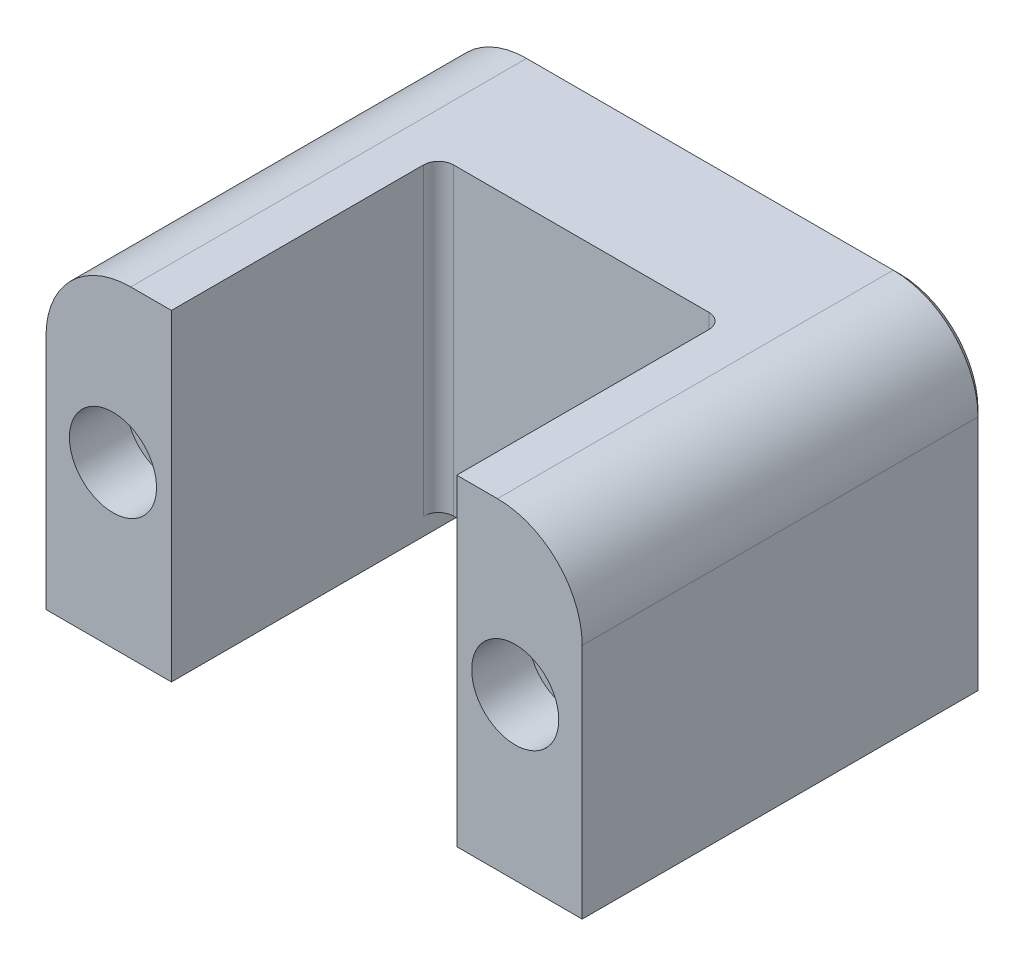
ISO-10303-21;
HEADER;
FILE_DESCRIPTION(('STEP AP214'),'2;1');
FILE_NAME('part.step','',(''),(''),'','','');
FILE_SCHEMA(('AUTOMOTIVE_DESIGN { 1 0 10303 214 1 1 1 1 }'));
ENDSEC;
DATA;
#1=APPLICATION_CONTEXT('core data for automotive mechanical design processes');
#2=APPLICATION_PROTOCOL_DEFINITION('international standard','automotive_design',2000,#1);
#3=PRODUCT_CONTEXT('',#1,'mechanical');
#4=PRODUCT('Part','Part','',(#3));
#5=PRODUCT_RELATED_PRODUCT_CATEGORY('part','',(#4));
#6=PRODUCT_DEFINITION_FORMATION('','',#4);
#7=PRODUCT_DEFINITION_CONTEXT('part definition',#1,'design');
#8=PRODUCT_DEFINITION('design','',#6,#7);
#9=PRODUCT_DEFINITION_SHAPE('','',#8);
#10=(LENGTH_UNIT() NAMED_UNIT(*) SI_UNIT(.MILLI.,.METRE.));
#11=(NAMED_UNIT(*) PLANE_ANGLE_UNIT() SI_UNIT($,.RADIAN.));
#12=(NAMED_UNIT(*) SI_UNIT($,.STERADIAN.) SOLID_ANGLE_UNIT());
#13=UNCERTAINTY_MEASURE_WITH_UNIT(LENGTH_MEASURE(1.E-05),#10,'distance_accuracy_value','');
#14=(GEOMETRIC_REPRESENTATION_CONTEXT(3) GLOBAL_UNCERTAINTY_ASSIGNED_CONTEXT((#13)) GLOBAL_UNIT_ASSIGNED_CONTEXT((#10,
#11,#12)) REPRESENTATION_CONTEXT('',''));
#15=CARTESIAN_POINT('',(0.,0.,0.));
#16=DIRECTION('',(0.,0.,1.));
#17=DIRECTION('',(1.,0.,0.));
#18=AXIS2_PLACEMENT_3D('',#15,#16,#17);
#19=CARTESIAN_POINT('',(-31.74365,38.1,-47.625));
#20=DIRECTION('',(0.,0.,1.));
#21=DIRECTION('',(1.,0.,0.));
#22=AXIS2_PLACEMENT_3D('',#19,#20,#21);
#23=PLANE('',#22);
#24=CARTESIAN_POINT('',(-23.8125,19.05,-47.625));
#25=DIRECTION('',(0.,0.,-1.));
#26=DIRECTION('',(-1.,0.,0.));
#27=AXIS2_PLACEMENT_3D('',#24,#25,#26);
#28=CIRCLE('',#27,3.5687);
#29=CARTESIAN_POINT('',(-27.3812,19.05,-47.625));
#30=VERTEX_POINT('',#29);
#31=EDGE_CURVE('E322',#30,#30,#28,.T.);
#32=ORIENTED_EDGE('',*,*,#31,.F.);
#33=EDGE_LOOP('',(#32));
#34=FACE_BOUND('',#33,.T.);
#35=CARTESIAN_POINT('',(21.71065,28.067,-47.625));
#36=DIRECTION('',(0.,0.,1.));
#37=DIRECTION('',(1.,0.,0.));
#38=AXIS2_PLACEMENT_3D('',#35,#36,#37);
#39=CIRCLE('',#38,9.27100000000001);
#40=CARTESIAN_POINT('',(21.71065,37.338,-47.625));
#41=VERTEX_POINT('',#40);
#42=CARTESIAN_POINT('',(30.98165,28.067,-47.625));
#43=VERTEX_POINT('',#42);
#44=EDGE_CURVE('E275',#41,#43,#39,.F.);
#45=ORIENTED_EDGE('',*,*,#44,.T.);
#46=DIRECTION('',(0.,-1.,0.));
#47=VECTOR('',#46,1.);
#48=CARTESIAN_POINT('',(30.98165,38.1,-47.625));
#49=LINE('',#48,#47);
#50=CARTESIAN_POINT('',(30.98165,0.,-47.625));
#51=VERTEX_POINT('',#50);
#52=EDGE_CURVE('E279',#43,#51,#49,.T.);
#53=ORIENTED_EDGE('',*,*,#52,.T.);
#54=DIRECTION('',(-1.,0.,0.));
#55=VECTOR('',#54,1.);
#56=CARTESIAN_POINT('',(-31.74365,0.,-47.625));
#57=LINE('',#56,#55);
#58=CARTESIAN_POINT('',(-30.98165,0.,-47.625));
#59=VERTEX_POINT('',#58);
#60=EDGE_CURVE('E173',#51,#59,#57,.T.);
#61=ORIENTED_EDGE('',*,*,#60,.T.);
#62=DIRECTION('',(0.,1.,0.));
#63=VECTOR('',#62,1.);
#64=CARTESIAN_POINT('',(-30.98165,38.1,-47.625));
#65=LINE('',#64,#63);
#66=CARTESIAN_POINT('',(-30.98165,28.067,-47.625));
#67=VERTEX_POINT('',#66);
#68=EDGE_CURVE('E277',#59,#67,#65,.T.);
#69=ORIENTED_EDGE('',*,*,#68,.T.);
#70=CARTESIAN_POINT('',(-21.71065,28.067,-47.625));
#71=DIRECTION('',(0.,0.,1.));
#72=DIRECTION('',(1.,0.,0.));
#73=AXIS2_PLACEMENT_3D('',#70,#71,#72);
#74=CIRCLE('',#73,9.27100000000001);
#75=CARTESIAN_POINT('',(-21.71065,37.338,-47.625));
#76=VERTEX_POINT('',#75);
#77=EDGE_CURVE('E273',#67,#76,#74,.F.);
#78=ORIENTED_EDGE('',*,*,#77,.T.);
#79=DIRECTION('',(1.,0.,0.));
#80=VECTOR('',#79,1.);
#81=CARTESIAN_POINT('',(-31.74365,37.338,-47.625));
#82=LINE('',#81,#80);
#83=EDGE_CURVE('E271',#76,#41,#82,.T.);
#84=ORIENTED_EDGE('',*,*,#83,.T.);
#85=EDGE_LOOP('',(#45,#53,#61,#69,#78,#84));
#86=FACE_BOUND('',#85,.T.);
#87=CARTESIAN_POINT('',(23.8125,19.05,-47.625));
#88=DIRECTION('',(0.,0.,1.));
#89=DIRECTION('',(1.,0.,0.));
#90=AXIS2_PLACEMENT_3D('',#87,#88,#89);
#91=CIRCLE('',#90,3.5687);
#92=CARTESIAN_POINT('',(27.3812,19.05,-47.625));
#93=VERTEX_POINT('',#92);
#94=EDGE_CURVE('E303',#93,#93,#91,.T.);
#95=ORIENTED_EDGE('',*,*,#94,.T.);
#96=EDGE_LOOP('',(#95));
#97=FACE_BOUND('',#96,.T.);
#98=ADVANCED_FACE('F32',(#34,#86,#97),#23,.F.);
#99=CARTESIAN_POINT('',(16.891,38.1,0.));
#100=DIRECTION('',(0.,0.,-1.));
#101=DIRECTION('',(-1.,0.,0.));
#102=AXIS2_PLACEMENT_3D('',#99,#100,#101);
#103=PLANE('',#102);
#104=DIRECTION('',(0.,-1.,0.));
#105=VECTOR('',#104,1.);
#106=CARTESIAN_POINT('',(31.74365,38.1,0.));
#107=LINE('',#106,#105);
#108=CARTESIAN_POINT('',(31.74365,28.067,0.));
#109=VERTEX_POINT('',#108);
#110=CARTESIAN_POINT('',(31.74365,0.,0.));
#111=VERTEX_POINT('',#110);
#112=EDGE_CURVE('E202',#109,#111,#107,.T.);
#113=ORIENTED_EDGE('',*,*,#112,.F.);
#114=CARTESIAN_POINT('',(21.71065,28.067,0.));
#115=DIRECTION('',(0.,0.,-1.));
#116=DIRECTION('',(-1.,0.,0.));
#117=AXIS2_PLACEMENT_3D('',#114,#115,#116);
#118=CIRCLE('',#117,10.033);
#119=CARTESIAN_POINT('',(21.71065,38.1,0.));
#120=VERTEX_POINT('',#119);
#121=EDGE_CURVE('E264',#109,#120,#118,.F.);
#122=ORIENTED_EDGE('',*,*,#121,.T.);
#123=DIRECTION('',(1.,0.,0.));
#124=VECTOR('',#123,1.);
#125=CARTESIAN_POINT('',(16.891,38.1,0.));
#126=LINE('',#125,#124);
#127=CARTESIAN_POINT('',(16.891,38.1,0.));
#128=VERTEX_POINT('',#127);
#129=EDGE_CURVE('E199',#128,#120,#126,.T.);
#130=ORIENTED_EDGE('',*,*,#129,.F.);
#131=DIRECTION('',(0.,-1.,0.));
#132=VECTOR('',#131,1.);
#133=CARTESIAN_POINT('',(16.891,38.1,0.));
#134=LINE('',#133,#132);
#135=CARTESIAN_POINT('',(16.891,0.,0.));
#136=VERTEX_POINT('',#135);
#137=EDGE_CURVE('E186',#128,#136,#134,.T.);
#138=ORIENTED_EDGE('',*,*,#137,.T.);
#139=DIRECTION('',(1.,0.,0.));
#140=VECTOR('',#139,1.);
#141=CARTESIAN_POINT('',(16.891,0.,0.));
#142=LINE('',#141,#140);
#143=EDGE_CURVE('E211',#136,#111,#142,.T.);
#144=ORIENTED_EDGE('',*,*,#143,.T.);
#145=EDGE_LOOP('',(#113,#122,#130,#138,#144));
#146=FACE_BOUND('',#145,.T.);
#147=CARTESIAN_POINT('',(23.8125,19.05,0.));
#148=DIRECTION('',(0.,0.,1.));
#149=DIRECTION('',(1.,0.,0.));
#150=AXIS2_PLACEMENT_3D('',#147,#148,#149);
#151=CIRCLE('',#150,5.1562);
#152=CARTESIAN_POINT('',(28.9687,19.05,0.));
#153=VERTEX_POINT('',#152);
#154=EDGE_CURVE('E319',#153,#153,#151,.T.);
#155=ORIENTED_EDGE('',*,*,#154,.F.);
#156=EDGE_LOOP('',(#155));
#157=FACE_BOUND('',#156,.T.);
#158=ADVANCED_FACE('F367',(#146,#157),#103,.F.);
#159=CARTESIAN_POINT('',(-31.74365,38.1,0.));
#160=DIRECTION('',(0.,0.,-1.));
#161=DIRECTION('',(-1.,0.,0.));
#162=AXIS2_PLACEMENT_3D('',#159,#160,#161);
#163=PLANE('',#162);
#164=DIRECTION('',(1.,0.,0.));
#165=VECTOR('',#164,1.);
#166=CARTESIAN_POINT('',(-31.74365,38.1,0.));
#167=LINE('',#166,#165);
#168=CARTESIAN_POINT('',(-21.71065,38.1,0.));
#169=VERTEX_POINT('',#168);
#170=CARTESIAN_POINT('',(-16.891,38.1,0.));
#171=VERTEX_POINT('',#170);
#172=EDGE_CURVE('E164',#169,#171,#167,.T.);
#173=ORIENTED_EDGE('',*,*,#172,.F.);
#174=CARTESIAN_POINT('',(-21.71065,28.067,0.));
#175=DIRECTION('',(0.,0.,-1.));
#176=DIRECTION('',(-1.,0.,0.));
#177=AXIS2_PLACEMENT_3D('',#174,#175,#176);
#178=CIRCLE('',#177,10.033);
#179=CARTESIAN_POINT('',(-31.74365,28.067,0.));
#180=VERTEX_POINT('',#179);
#181=EDGE_CURVE('E266',#169,#180,#178,.F.);
#182=ORIENTED_EDGE('',*,*,#181,.T.);
#183=DIRECTION('',(0.,-1.,0.));
#184=VECTOR('',#183,1.);
#185=CARTESIAN_POINT('',(-31.74365,38.1,0.));
#186=LINE('',#185,#184);
#187=CARTESIAN_POINT('',(-31.74365,0.,0.));
#188=VERTEX_POINT('',#187);
#189=EDGE_CURVE('E185',#180,#188,#186,.T.);
#190=ORIENTED_EDGE('',*,*,#189,.T.);
#191=DIRECTION('',(1.,0.,0.));
#192=VECTOR('',#191,1.);
#193=CARTESIAN_POINT('',(-31.74365,0.,0.));
#194=LINE('',#193,#192);
#195=CARTESIAN_POINT('',(-16.891,0.,0.));
#196=VERTEX_POINT('',#195);
#197=EDGE_CURVE('E181',#188,#196,#194,.T.);
#198=ORIENTED_EDGE('',*,*,#197,.T.);
#199=DIRECTION('',(0.,-1.,0.));
#200=VECTOR('',#199,1.);
#201=CARTESIAN_POINT('',(-16.891,38.1,0.));
#202=LINE('',#201,#200);
#203=EDGE_CURVE('E176',#171,#196,#202,.T.);
#204=ORIENTED_EDGE('',*,*,#203,.F.);
#205=EDGE_LOOP('',(#173,#182,#190,#198,#204));
#206=FACE_BOUND('',#205,.T.);
#207=CARTESIAN_POINT('',(-23.8125,19.05,0.));
#208=DIRECTION('',(0.,0.,-1.));
#209=DIRECTION('',(-1.,0.,0.));
#210=AXIS2_PLACEMENT_3D('',#207,#208,#209);
#211=CIRCLE('',#210,5.1562);
#212=CARTESIAN_POINT('',(-28.9687,19.05,0.));
#213=VERTEX_POINT('',#212);
#214=EDGE_CURVE('E331',#213,#213,#211,.T.);
#215=ORIENTED_EDGE('',*,*,#214,.T.);
#216=EDGE_LOOP('',(#215));
#217=FACE_BOUND('',#216,.T.);
#218=ADVANCED_FACE('F177',(#206,#217),#163,.F.);
#219=CARTESIAN_POINT('',(-31.74365,38.1,0.));
#220=DIRECTION('',(1.,0.,0.));
#221=DIRECTION('',(0.,0.,-1.));
#222=AXIS2_PLACEMENT_3D('',#219,#220,#221);
#223=PLANE('',#222);
#224=DIRECTION('',(0.,0.,1.));
#225=VECTOR('',#224,1.);
#226=CARTESIAN_POINT('',(-31.74365,28.067,0.));
#227=LINE('',#226,#225);
#228=CARTESIAN_POINT('',(-31.74365,28.067,-46.863));
#229=VERTEX_POINT('',#228);
#230=EDGE_CURVE('E268',#180,#229,#227,.F.);
#231=ORIENTED_EDGE('',*,*,#230,.T.);
#232=DIRECTION('',(0.,-1.,0.));
#233=VECTOR('',#232,1.);
#234=CARTESIAN_POINT('',(-31.74365,38.1,-46.863));
#235=LINE('',#234,#233);
#236=CARTESIAN_POINT('',(-31.74365,0.,-46.863));
#237=VERTEX_POINT('',#236);
#238=EDGE_CURVE('E288',#229,#237,#235,.T.);
#239=ORIENTED_EDGE('',*,*,#238,.T.);
#240=DIRECTION('',(0.,0.,1.));
#241=VECTOR('',#240,1.);
#242=CARTESIAN_POINT('',(-31.74365,0.,0.));
#243=LINE('',#242,#241);
#244=EDGE_CURVE('E203',#237,#188,#243,.T.);
#245=ORIENTED_EDGE('',*,*,#244,.T.);
#246=ORIENTED_EDGE('',*,*,#189,.F.);
#247=EDGE_LOOP('',(#231,#239,#245,#246));
#248=FACE_BOUND('',#247,.T.);
#249=ADVANCED_FACE('F420',(#248),#223,.F.);
#250=CARTESIAN_POINT('',(-16.891,38.1,0.));
#251=DIRECTION('',(-1.,0.,0.));
#252=DIRECTION('',(0.,0.,1.));
#253=AXIS2_PLACEMENT_3D('',#250,#251,#252);
#254=PLANE('',#253);
#255=DIRECTION('',(0.,0.,-1.));
#256=VECTOR('',#255,1.);
#257=CARTESIAN_POINT('',(-16.891,2.0828,-40.513));
#258=LINE('',#257,#256);
#259=CARTESIAN_POINT('',(-16.891,2.0828,-29.845));
#260=VERTEX_POINT('',#259);
#261=CARTESIAN_POINT('',(-16.891,2.0828,-38.481));
#262=VERTEX_POINT('',#261);
#263=EDGE_CURVE('E335',#260,#262,#258,.T.);
#264=ORIENTED_EDGE('',*,*,#263,.F.);
#265=DIRECTION('',(0.,-1.,0.));
#266=VECTOR('',#265,1.);
#267=CARTESIAN_POINT('',(-16.891,38.1,-29.845));
#268=LINE('',#267,#266);
#269=CARTESIAN_POINT('',(-16.891,38.1,-29.845));
#270=VERTEX_POINT('',#269);
#271=EDGE_CURVE('E190',#260,#270,#268,.F.);
#272=ORIENTED_EDGE('',*,*,#271,.T.);
#273=DIRECTION('',(0.,0.,-1.));
#274=VECTOR('',#273,1.);
#275=CARTESIAN_POINT('',(-16.891,38.1,0.));
#276=LINE('',#275,#274);
#277=EDGE_CURVE('E168',#171,#270,#276,.T.);
#278=ORIENTED_EDGE('',*,*,#277,.F.);
#279=ORIENTED_EDGE('',*,*,#203,.T.);
#280=DIRECTION('',(0.,0.,-1.));
#281=VECTOR('',#280,1.);
#282=CARTESIAN_POINT('',(-16.891,0.,0.));
#283=LINE('',#282,#281);
#284=CARTESIAN_POINT('',(-16.891,0.,-38.481));
#285=VERTEX_POINT('',#284);
#286=EDGE_CURVE('E207',#196,#285,#283,.T.);
#287=ORIENTED_EDGE('',*,*,#286,.T.);
#288=DIRECTION('',(0.,-1.,0.));
#289=VECTOR('',#288,1.);
#290=CARTESIAN_POINT('',(-16.891,2.0828,-38.481));
#291=LINE('',#290,#289);
#292=EDGE_CURVE('E235',#285,#262,#291,.F.);
#293=ORIENTED_EDGE('',*,*,#292,.T.);
#294=EDGE_LOOP('',(#264,#272,#278,#279,#287,#293));
#295=FACE_BOUND('',#294,.T.);
#296=ADVANCED_FACE('F188',(#295),#254,.F.);
#297=CARTESIAN_POINT('',(-16.891,38.1,-31.623));
#298=DIRECTION('',(0.,0.,-1.));
#299=DIRECTION('',(-1.,0.,0.));
#300=AXIS2_PLACEMENT_3D('',#297,#298,#299);
#301=PLANE('',#300);
#302=DIRECTION('',(1.,0.,0.));
#303=VECTOR('',#302,1.);
#304=CARTESIAN_POINT('',(-16.891,2.0828,-31.623));
#305=LINE('',#304,#303);
#306=CARTESIAN_POINT('',(-15.113,2.0828,-31.623));
#307=VERTEX_POINT('',#306);
#308=CARTESIAN_POINT('',(15.113,2.0828,-31.623));
#309=VERTEX_POINT('',#308);
#310=EDGE_CURVE('E205',#307,#309,#305,.T.);
#311=ORIENTED_EDGE('',*,*,#310,.T.);
#312=DIRECTION('',(0.,-1.,0.));
#313=VECTOR('',#312,1.);
#314=CARTESIAN_POINT('',(15.113,38.1,-31.623));
#315=LINE('',#314,#313);
#316=CARTESIAN_POINT('',(15.113,38.1,-31.623));
#317=VERTEX_POINT('',#316);
#318=EDGE_CURVE('E247',#309,#317,#315,.F.);
#319=ORIENTED_EDGE('',*,*,#318,.T.);
#320=DIRECTION('',(1.,0.,0.));
#321=VECTOR('',#320,1.);
#322=CARTESIAN_POINT('',(-16.891,38.1,-31.623));
#323=LINE('',#322,#321);
#324=CARTESIAN_POINT('',(-15.113,38.1,-31.623));
#325=VERTEX_POINT('',#324);
#326=EDGE_CURVE('E191',#325,#317,#323,.T.);
#327=ORIENTED_EDGE('',*,*,#326,.F.);
#328=DIRECTION('',(0.,-1.,0.));
#329=VECTOR('',#328,1.);
#330=CARTESIAN_POINT('',(-15.113,2.0828,-31.623));
#331=LINE('',#330,#329);
#332=EDGE_CURVE('E244',#325,#307,#331,.T.);
#333=ORIENTED_EDGE('',*,*,#332,.T.);
#334=EDGE_LOOP('',(#311,#319,#327,#333));
#335=FACE_BOUND('',#334,.T.);
#336=ADVANCED_FACE('F348',(#335),#301,.F.);
#337=CARTESIAN_POINT('',(16.891,38.1,0.));
#338=DIRECTION('',(1.,0.,0.));
#339=DIRECTION('',(0.,0.,-1.));
#340=AXIS2_PLACEMENT_3D('',#337,#338,#339);
#341=PLANE('',#340);
#342=DIRECTION('',(0.,0.,1.));
#343=VECTOR('',#342,1.);
#344=CARTESIAN_POINT('',(16.891,38.1,0.));
#345=LINE('',#344,#343);
#346=CARTESIAN_POINT('',(16.891,38.1,-29.845));
#347=VERTEX_POINT('',#346);
#348=EDGE_CURVE('E194',#347,#128,#345,.T.);
#349=ORIENTED_EDGE('',*,*,#348,.F.);
#350=DIRECTION('',(0.,-1.,0.));
#351=VECTOR('',#350,1.);
#352=CARTESIAN_POINT('',(16.891,2.0828,-29.845));
#353=LINE('',#352,#351);
#354=CARTESIAN_POINT('',(16.891,2.0828,-29.845));
#355=VERTEX_POINT('',#354);
#356=EDGE_CURVE('E241',#347,#355,#353,.T.);
#357=ORIENTED_EDGE('',*,*,#356,.T.);
#358=DIRECTION('',(0.,0.,1.));
#359=VECTOR('',#358,1.);
#360=CARTESIAN_POINT('',(16.891,2.0828,-40.513));
#361=LINE('',#360,#359);
#362=CARTESIAN_POINT('',(16.891,2.0828,-38.481));
#363=VERTEX_POINT('',#362);
#364=EDGE_CURVE('E341',#363,#355,#361,.T.);
#365=ORIENTED_EDGE('',*,*,#364,.F.);
#366=DIRECTION('',(0.,-1.,0.));
#367=VECTOR('',#366,1.);
#368=CARTESIAN_POINT('',(16.891,0.,-38.481));
#369=LINE('',#368,#367);
#370=CARTESIAN_POINT('',(16.891,0.,-38.481));
#371=VERTEX_POINT('',#370);
#372=EDGE_CURVE('E223',#363,#371,#369,.T.);
#373=ORIENTED_EDGE('',*,*,#372,.T.);
#374=DIRECTION('',(0.,0.,1.));
#375=VECTOR('',#374,1.);
#376=CARTESIAN_POINT('',(16.891,0.,0.));
#377=LINE('',#376,#375);
#378=EDGE_CURVE('E209',#371,#136,#377,.T.);
#379=ORIENTED_EDGE('',*,*,#378,.T.);
#380=ORIENTED_EDGE('',*,*,#137,.F.);
#381=EDGE_LOOP('',(#349,#357,#365,#373,#379,#380));
#382=FACE_BOUND('',#381,.T.);
#383=ADVANCED_FACE('F360',(#382),#341,.F.);
#384=CARTESIAN_POINT('',(31.74365,38.1,0.));
#385=DIRECTION('',(-1.,0.,0.));
#386=DIRECTION('',(0.,0.,1.));
#387=AXIS2_PLACEMENT_3D('',#384,#385,#386);
#388=PLANE('',#387);
#389=DIRECTION('',(0.,0.,-1.));
#390=VECTOR('',#389,1.);
#391=CARTESIAN_POINT('',(31.74365,0.,0.));
#392=LINE('',#391,#390);
#393=CARTESIAN_POINT('',(31.74365,0.,-46.863));
#394=VERTEX_POINT('',#393);
#395=EDGE_CURVE('E214',#111,#394,#392,.T.);
#396=ORIENTED_EDGE('',*,*,#395,.T.);
#397=DIRECTION('',(0.,1.,0.));
#398=VECTOR('',#397,1.);
#399=CARTESIAN_POINT('',(31.74365,38.1,-46.863));
#400=LINE('',#399,#398);
#401=CARTESIAN_POINT('',(31.74365,28.067,-46.863));
#402=VERTEX_POINT('',#401);
#403=EDGE_CURVE('E286',#394,#402,#400,.T.);
#404=ORIENTED_EDGE('',*,*,#403,.T.);
#405=DIRECTION('',(0.,0.,-1.));
#406=VECTOR('',#405,1.);
#407=CARTESIAN_POINT('',(31.74365,28.067,0.));
#408=LINE('',#407,#406);
#409=EDGE_CURVE('E262',#402,#109,#408,.F.);
#410=ORIENTED_EDGE('',*,*,#409,.T.);
#411=ORIENTED_EDGE('',*,*,#112,.T.);
#412=EDGE_LOOP('',(#396,#404,#410,#411));
#413=FACE_BOUND('',#412,.T.);
#414=ADVANCED_FACE('F411',(#413),#388,.F.);
#415=CARTESIAN_POINT('',(-31.74365,38.1,-47.625));
#416=DIRECTION('',(0.,-1.,0.));
#417=DIRECTION('',(0.,0.,-1.));
#418=AXIS2_PLACEMENT_3D('',#415,#416,#417);
#419=PLANE('',#418);
#420=DIRECTION('',(0.,0.,-1.));
#421=VECTOR('',#420,1.);
#422=CARTESIAN_POINT('',(21.71065,38.1,-47.625));
#423=LINE('',#422,#421);
#424=CARTESIAN_POINT('',(21.71065,38.1,-46.863));
#425=VERTEX_POINT('',#424);
#426=EDGE_CURVE('E260',#120,#425,#423,.T.);
#427=ORIENTED_EDGE('',*,*,#426,.T.);
#428=DIRECTION('',(-1.,0.,0.));
#429=VECTOR('',#428,1.);
#430=CARTESIAN_POINT('',(-31.74365,38.1,-46.863));
#431=LINE('',#430,#429);
#432=CARTESIAN_POINT('',(-21.71065,38.1,-46.863));
#433=VERTEX_POINT('',#432);
#434=EDGE_CURVE('E11',#425,#433,#431,.T.);
#435=ORIENTED_EDGE('',*,*,#434,.T.);
#436=DIRECTION('',(0.,0.,1.));
#437=VECTOR('',#436,1.);
#438=CARTESIAN_POINT('',(-21.71065,38.1,-47.625));
#439=LINE('',#438,#437);
#440=EDGE_CURVE('E170',#433,#169,#439,.T.);
#441=ORIENTED_EDGE('',*,*,#440,.T.);
#442=ORIENTED_EDGE('',*,*,#172,.T.);
#443=ORIENTED_EDGE('',*,*,#277,.T.);
#444=CARTESIAN_POINT('',(-15.113,38.1,-29.845));
#445=DIRECTION('',(0.,-1.,0.));
#446=DIRECTION('',(0.,0.,-1.));
#447=AXIS2_PLACEMENT_3D('',#444,#445,#446);
#448=CIRCLE('',#447,1.778);
#449=EDGE_CURVE('E257',#270,#325,#448,.T.);
#450=ORIENTED_EDGE('',*,*,#449,.T.);
#451=ORIENTED_EDGE('',*,*,#326,.T.);
#452=CARTESIAN_POINT('',(15.113,38.1,-29.845));
#453=DIRECTION('',(0.,-1.,0.));
#454=DIRECTION('',(0.,0.,-1.));
#455=AXIS2_PLACEMENT_3D('',#452,#453,#454);
#456=CIRCLE('',#455,1.778);
#457=EDGE_CURVE('E252',#317,#347,#456,.T.);
#458=ORIENTED_EDGE('',*,*,#457,.T.);
#459=ORIENTED_EDGE('',*,*,#348,.T.);
#460=ORIENTED_EDGE('',*,*,#129,.T.);
#461=EDGE_LOOP('',(#427,#435,#441,#442,#443,#450,#451,#458,#459,#460));
#462=FACE_BOUND('',#461,.T.);
#463=ADVANCED_FACE('F166',(#462),#419,.F.);
#464=CARTESIAN_POINT('',(-31.74365,0.,-47.625));
#465=DIRECTION('',(0.,-1.,0.));
#466=DIRECTION('',(0.,0.,-1.));
#467=AXIS2_PLACEMENT_3D('',#464,#465,#466);
#468=PLANE('',#467);
#469=ORIENTED_EDGE('',*,*,#60,.F.);
#470=DIRECTION('',(-0.707106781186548,0.,-0.707106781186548));
#471=VECTOR('',#470,1.);
#472=CARTESIAN_POINT('',(-0.380999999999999,0.,-78.98765));
#473=LINE('',#472,#471);
#474=EDGE_CURVE('E284',#51,#394,#473,.F.);
#475=ORIENTED_EDGE('',*,*,#474,.T.);
#476=ORIENTED_EDGE('',*,*,#395,.F.);
#477=ORIENTED_EDGE('',*,*,#143,.F.);
#478=ORIENTED_EDGE('',*,*,#378,.F.);
#479=CARTESIAN_POINT('',(14.859,0.,-38.481));
#480=DIRECTION('',(0.,-1.,0.));
#481=DIRECTION('',(0.,0.,-1.));
#482=AXIS2_PLACEMENT_3D('',#479,#480,#481);
#483=CIRCLE('',#482,2.032);
#484=CARTESIAN_POINT('',(14.859,0.,-40.513));
#485=VERTEX_POINT('',#484);
#486=EDGE_CURVE('E237',#371,#485,#483,.F.);
#487=ORIENTED_EDGE('',*,*,#486,.T.);
#488=DIRECTION('',(1.,0.,0.));
#489=VECTOR('',#488,1.);
#490=CARTESIAN_POINT('',(-16.891,0.,-40.513));
#491=LINE('',#490,#489);
#492=CARTESIAN_POINT('',(-14.859,0.,-40.513));
#493=VERTEX_POINT('',#492);
#494=EDGE_CURVE('E334',#493,#485,#491,.T.);
#495=ORIENTED_EDGE('',*,*,#494,.F.);
#496=CARTESIAN_POINT('',(-14.859,0.,-38.481));
#497=DIRECTION('',(0.,-1.,0.));
#498=DIRECTION('',(0.,0.,-1.));
#499=AXIS2_PLACEMENT_3D('',#496,#497,#498);
#500=CIRCLE('',#499,2.032);
#501=EDGE_CURVE('E239',#493,#285,#500,.F.);
#502=ORIENTED_EDGE('',*,*,#501,.T.);
#503=ORIENTED_EDGE('',*,*,#286,.F.);
#504=ORIENTED_EDGE('',*,*,#197,.F.);
#505=ORIENTED_EDGE('',*,*,#244,.F.);
#506=DIRECTION('',(-0.707106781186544,0.,0.707106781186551));
#507=VECTOR('',#506,1.);
#508=CARTESIAN_POINT('',(-31.36265,0.,-47.244));
#509=LINE('',#508,#507);
#510=EDGE_CURVE('E282',#237,#59,#509,.F.);
#511=ORIENTED_EDGE('',*,*,#510,.T.);
#512=EDGE_LOOP('',(#469,#475,#476,#477,#478,#487,#495,#502,#503,#504,#505,#511));
#513=FACE_BOUND('',#512,.T.);
#514=ADVANCED_FACE('F385',(#513),#468,.T.);
#515=CARTESIAN_POINT('',(-16.891,2.0828,-28.7428747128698));
#516=DIRECTION('',(0.,1.,0.));
#517=DIRECTION('',(0.,0.,1.));
#518=AXIS2_PLACEMENT_3D('',#515,#516,#517);
#519=PLANE('',#518);
#520=DIRECTION('',(1.,0.,0.));
#521=VECTOR('',#520,1.);
#522=CARTESIAN_POINT('',(-16.891,2.0828,-40.513));
#523=LINE('',#522,#521);
#524=CARTESIAN_POINT('',(-14.859,2.0828,-40.513));
#525=VERTEX_POINT('',#524);
#526=CARTESIAN_POINT('',(14.859,2.0828,-40.513));
#527=VERTEX_POINT('',#526);
#528=EDGE_CURVE('E338',#525,#527,#523,.T.);
#529=ORIENTED_EDGE('',*,*,#528,.T.);
#530=CARTESIAN_POINT('',(14.859,2.0828,-38.481));
#531=DIRECTION('',(0.,1.,0.));
#532=DIRECTION('',(0.,0.,1.));
#533=AXIS2_PLACEMENT_3D('',#530,#531,#532);
#534=CIRCLE('',#533,2.032);
#535=EDGE_CURVE('E233',#527,#363,#534,.F.);
#536=ORIENTED_EDGE('',*,*,#535,.T.);
#537=ORIENTED_EDGE('',*,*,#364,.T.);
#538=CARTESIAN_POINT('',(15.113,2.0828,-29.845));
#539=DIRECTION('',(0.,1.,0.));
#540=DIRECTION('',(0.,0.,1.));
#541=AXIS2_PLACEMENT_3D('',#538,#539,#540);
#542=CIRCLE('',#541,1.778);
#543=EDGE_CURVE('E250',#355,#309,#542,.T.);
#544=ORIENTED_EDGE('',*,*,#543,.T.);
#545=ORIENTED_EDGE('',*,*,#310,.F.);
#546=CARTESIAN_POINT('',(-15.113,2.0828,-29.845));
#547=DIRECTION('',(0.,1.,0.));
#548=DIRECTION('',(0.,0.,1.));
#549=AXIS2_PLACEMENT_3D('',#546,#547,#548);
#550=CIRCLE('',#549,1.778);
#551=EDGE_CURVE('E254',#307,#260,#550,.T.);
#552=ORIENTED_EDGE('',*,*,#551,.T.);
#553=ORIENTED_EDGE('',*,*,#263,.T.);
#554=CARTESIAN_POINT('',(-14.859,2.0828,-38.481));
#555=DIRECTION('',(0.,1.,0.));
#556=DIRECTION('',(0.,0.,1.));
#557=AXIS2_PLACEMENT_3D('',#554,#555,#556);
#558=CIRCLE('',#557,2.032);
#559=EDGE_CURVE('E231',#262,#525,#558,.F.);
#560=ORIENTED_EDGE('',*,*,#559,.T.);
#561=EDGE_LOOP('',(#529,#536,#537,#544,#545,#552,#553,#560));
#562=FACE_BOUND('',#561,.T.);
#563=ADVANCED_FACE('F496',(#562),#519,.F.);
#564=CARTESIAN_POINT('',(-16.891,2.0828,-40.513));
#565=DIRECTION('',(0.,0.,-1.));
#566=DIRECTION('',(-1.,0.,0.));
#567=AXIS2_PLACEMENT_3D('',#564,#565,#566);
#568=PLANE('',#567);
#569=ORIENTED_EDGE('',*,*,#494,.T.);
#570=DIRECTION('',(0.,-1.,0.));
#571=VECTOR('',#570,1.);
#572=CARTESIAN_POINT('',(14.859,2.0828,-40.513));
#573=LINE('',#572,#571);
#574=EDGE_CURVE('E229',#485,#527,#573,.F.);
#575=ORIENTED_EDGE('',*,*,#574,.T.);
#576=ORIENTED_EDGE('',*,*,#528,.F.);
#577=DIRECTION('',(0.,-1.,0.));
#578=VECTOR('',#577,1.);
#579=CARTESIAN_POINT('',(-14.859,0.,-40.513));
#580=LINE('',#579,#578);
#581=EDGE_CURVE('E226',#525,#493,#580,.T.);
#582=ORIENTED_EDGE('',*,*,#581,.T.);
#583=EDGE_LOOP('',(#569,#575,#576,#582));
#584=FACE_BOUND('',#583,.T.);
#585=ADVANCED_FACE('F430',(#584),#568,.F.);
#586=CARTESIAN_POINT('',(14.859,38.1,-38.481));
#587=DIRECTION('',(0.,1.,0.));
#588=DIRECTION('',(0.,0.,1.));
#589=AXIS2_PLACEMENT_3D('',#586,#587,#588);
#590=CYLINDRICAL_SURFACE('',#589,2.032);
#591=ORIENTED_EDGE('',*,*,#535,.F.);
#592=ORIENTED_EDGE('',*,*,#574,.F.);
#593=ORIENTED_EDGE('',*,*,#486,.F.);
#594=ORIENTED_EDGE('',*,*,#372,.F.);
#595=EDGE_LOOP('',(#591,#592,#593,#594));
#596=FACE_BOUND('',#595,.T.);
#597=ADVANCED_FACE('F426',(#596),#590,.F.);
#598=CARTESIAN_POINT('',(-14.859,2.0828,-38.481));
#599=DIRECTION('',(0.,1.,0.));
#600=DIRECTION('',(0.,0.,1.));
#601=AXIS2_PLACEMENT_3D('',#598,#599,#600);
#602=CYLINDRICAL_SURFACE('',#601,2.032);
#603=ORIENTED_EDGE('',*,*,#559,.F.);
#604=ORIENTED_EDGE('',*,*,#292,.F.);
#605=ORIENTED_EDGE('',*,*,#501,.F.);
#606=ORIENTED_EDGE('',*,*,#581,.F.);
#607=EDGE_LOOP('',(#603,#604,#605,#606));
#608=FACE_BOUND('',#607,.T.);
#609=ADVANCED_FACE('F429',(#608),#602,.F.);
#610=CARTESIAN_POINT('',(15.113,38.1,-29.845));
#611=DIRECTION('',(0.,1.,0.));
#612=DIRECTION('',(0.,0.,1.));
#613=AXIS2_PLACEMENT_3D('',#610,#611,#612);
#614=CYLINDRICAL_SURFACE('',#613,1.778);
#615=ORIENTED_EDGE('',*,*,#457,.F.);
#616=ORIENTED_EDGE('',*,*,#318,.F.);
#617=ORIENTED_EDGE('',*,*,#543,.F.);
#618=ORIENTED_EDGE('',*,*,#356,.F.);
#619=EDGE_LOOP('',(#615,#616,#617,#618));
#620=FACE_BOUND('',#619,.T.);
#621=ADVANCED_FACE('F355',(#620),#614,.F.);
#622=CARTESIAN_POINT('',(-15.113,38.1,-29.845));
#623=DIRECTION('',(0.,1.,0.));
#624=DIRECTION('',(0.,0.,1.));
#625=AXIS2_PLACEMENT_3D('',#622,#623,#624);
#626=CYLINDRICAL_SURFACE('',#625,1.778);
#627=ORIENTED_EDGE('',*,*,#449,.F.);
#628=ORIENTED_EDGE('',*,*,#271,.F.);
#629=ORIENTED_EDGE('',*,*,#551,.F.);
#630=ORIENTED_EDGE('',*,*,#332,.F.);
#631=EDGE_LOOP('',(#627,#628,#629,#630));
#632=FACE_BOUND('',#631,.T.);
#633=ADVANCED_FACE('F437',(#632),#626,.F.);
#634=CARTESIAN_POINT('',(-23.8125,19.05,-4.7498));
#635=DIRECTION('',(0.,0.,-1.));
#636=DIRECTION('',(-1.,0.,0.));
#637=AXIS2_PLACEMENT_3D('',#634,#635,#636);
#638=CYLINDRICAL_SURFACE('',#637,5.1562);
#639=CARTESIAN_POINT('',(-23.8125,19.05,-6.7564));
#640=DIRECTION('',(0.,0.,-1.));
#641=DIRECTION('',(-1.,0.,0.));
#642=AXIS2_PLACEMENT_3D('',#639,#640,#641);
#643=CIRCLE('',#642,5.1562);
#644=CARTESIAN_POINT('',(-28.9687,19.05,-6.7564));
#645=VERTEX_POINT('',#644);
#646=EDGE_CURVE('E328',#645,#645,#643,.T.);
#647=ORIENTED_EDGE('',*,*,#646,.T.);
#648=EDGE_LOOP('',(#647));
#649=FACE_BOUND('',#648,.T.);
#650=ORIENTED_EDGE('',*,*,#214,.F.);
#651=EDGE_LOOP('',(#650));
#652=FACE_BOUND('',#651,.T.);
#653=ADVANCED_FACE('F440',(#649,#652),#638,.F.);
#654=CARTESIAN_POINT('',(-18.6563,19.05,-6.7564));
#655=DIRECTION('',(0.,0.,1.));
#656=DIRECTION('',(1.,0.,0.));
#657=AXIS2_PLACEMENT_3D('',#654,#655,#656);
#658=PLANE('',#657);
#659=CARTESIAN_POINT('',(-23.8125,19.05,-6.7564));
#660=DIRECTION('',(0.,0.,-1.));
#661=DIRECTION('',(-1.,0.,0.));
#662=AXIS2_PLACEMENT_3D('',#659,#660,#661);
#663=CIRCLE('',#662,3.5687);
#664=CARTESIAN_POINT('',(-27.3812,19.05,-6.7564));
#665=VERTEX_POINT('',#664);
#666=EDGE_CURVE('E325',#665,#665,#663,.T.);
#667=ORIENTED_EDGE('',*,*,#666,.T.);
#668=EDGE_LOOP('',(#667));
#669=FACE_BOUND('',#668,.T.);
#670=ORIENTED_EDGE('',*,*,#646,.F.);
#671=EDGE_LOOP('',(#670));
#672=FACE_BOUND('',#671,.T.);
#673=ADVANCED_FACE('F573',(#669,#672),#658,.T.);
#674=CARTESIAN_POINT('',(-23.8125,19.05,-4.7498));
#675=DIRECTION('',(0.,0.,-1.));
#676=DIRECTION('',(-1.,0.,0.));
#677=AXIS2_PLACEMENT_3D('',#674,#675,#676);
#678=CYLINDRICAL_SURFACE('',#677,3.5687);
#679=ORIENTED_EDGE('',*,*,#31,.T.);
#680=EDGE_LOOP('',(#679));
#681=FACE_BOUND('',#680,.T.);
#682=ORIENTED_EDGE('',*,*,#666,.F.);
#683=EDGE_LOOP('',(#682));
#684=FACE_BOUND('',#683,.T.);
#685=ADVANCED_FACE('F564',(#681,#684),#678,.F.);
#686=CARTESIAN_POINT('',(23.8125,19.05,-4.7498));
#687=DIRECTION('',(0.,0.,-1.));
#688=DIRECTION('',(1.,0.,0.));
#689=AXIS2_PLACEMENT_3D('',#686,#687,#688);
#690=CYLINDRICAL_SURFACE('',#689,5.1562);
#691=CARTESIAN_POINT('',(23.8125,19.05,-6.7564));
#692=DIRECTION('',(0.,0.,1.));
#693=DIRECTION('',(1.,0.,0.));
#694=AXIS2_PLACEMENT_3D('',#691,#692,#693);
#695=CIRCLE('',#694,5.1562);
#696=CARTESIAN_POINT('',(28.9687,19.05,-6.7564));
#697=VERTEX_POINT('',#696);
#698=EDGE_CURVE('E314',#697,#697,#695,.T.);
#699=ORIENTED_EDGE('',*,*,#698,.F.);
#700=EDGE_LOOP('',(#699));
#701=FACE_BOUND('',#700,.T.);
#702=ORIENTED_EDGE('',*,*,#154,.T.);
#703=EDGE_LOOP('',(#702));
#704=FACE_BOUND('',#703,.T.);
#705=ADVANCED_FACE('F555',(#701,#704),#690,.F.);
#706=CARTESIAN_POINT('',(18.6563,19.05,-6.7564));
#707=DIRECTION('',(0.,0.,1.));
#708=DIRECTION('',(-1.,0.,0.));
#709=AXIS2_PLACEMENT_3D('',#706,#707,#708);
#710=PLANE('',#709);
#711=CARTESIAN_POINT('',(23.8125,19.05,-6.7564));
#712=DIRECTION('',(0.,0.,1.));
#713=DIRECTION('',(1.,0.,0.));
#714=AXIS2_PLACEMENT_3D('',#711,#712,#713);
#715=CIRCLE('',#714,3.5687);
#716=CARTESIAN_POINT('',(27.3812,19.05,-6.7564));
#717=VERTEX_POINT('',#716);
#718=EDGE_CURVE('E309',#717,#717,#715,.T.);
#719=ORIENTED_EDGE('',*,*,#718,.F.);
#720=EDGE_LOOP('',(#719));
#721=FACE_BOUND('',#720,.T.);
#722=ORIENTED_EDGE('',*,*,#698,.T.);
#723=EDGE_LOOP('',(#722));
#724=FACE_BOUND('',#723,.T.);
#725=ADVANCED_FACE('F545',(#721,#724),#710,.T.);
#726=CARTESIAN_POINT('',(23.8125,19.05,-4.7498));
#727=DIRECTION('',(0.,0.,-1.));
#728=DIRECTION('',(1.,0.,0.));
#729=AXIS2_PLACEMENT_3D('',#726,#727,#728);
#730=CYLINDRICAL_SURFACE('',#729,3.5687);
#731=ORIENTED_EDGE('',*,*,#94,.F.);
#732=EDGE_LOOP('',(#731));
#733=FACE_BOUND('',#732,.T.);
#734=ORIENTED_EDGE('',*,*,#718,.T.);
#735=EDGE_LOOP('',(#734));
#736=FACE_BOUND('',#735,.T.);
#737=ADVANCED_FACE('F445',(#733,#736),#730,.F.);
#738=CARTESIAN_POINT('',(21.71065,28.067,-47.625));
#739=DIRECTION('',(0.,0.,-1.));
#740=DIRECTION('',(-1.,0.,0.));
#741=AXIS2_PLACEMENT_3D('',#738,#739,#740);
#742=CYLINDRICAL_SURFACE('',#741,10.033);
#743=ORIENTED_EDGE('',*,*,#409,.F.);
#744=CARTESIAN_POINT('',(21.71065,28.067,-46.863));
#745=DIRECTION('',(0.,0.,1.));
#746=DIRECTION('',(1.,0.,0.));
#747=AXIS2_PLACEMENT_3D('',#744,#745,#746);
#748=CIRCLE('',#747,10.033);
#749=EDGE_CURVE('E55',#402,#425,#748,.T.);
#750=ORIENTED_EDGE('',*,*,#749,.T.);
#751=ORIENTED_EDGE('',*,*,#426,.F.);
#752=ORIENTED_EDGE('',*,*,#121,.F.);
#753=EDGE_LOOP('',(#743,#750,#751,#752));
#754=FACE_BOUND('',#753,.T.);
#755=ADVANCED_FACE('F370',(#754),#742,.T.);
#756=CARTESIAN_POINT('',(-21.71065,28.067,-47.625));
#757=DIRECTION('',(0.,0.,1.));
#758=DIRECTION('',(1.,0.,0.));
#759=AXIS2_PLACEMENT_3D('',#756,#757,#758);
#760=CYLINDRICAL_SURFACE('',#759,10.033);
#761=ORIENTED_EDGE('',*,*,#440,.F.);
#762=CARTESIAN_POINT('',(-21.71065,28.067,-46.863));
#763=DIRECTION('',(0.,0.,1.));
#764=DIRECTION('',(1.,0.,0.));
#765=AXIS2_PLACEMENT_3D('',#762,#763,#764);
#766=CIRCLE('',#765,10.033);
#767=EDGE_CURVE('E41',#433,#229,#766,.T.);
#768=ORIENTED_EDGE('',*,*,#767,.T.);
#769=ORIENTED_EDGE('',*,*,#230,.F.);
#770=ORIENTED_EDGE('',*,*,#181,.F.);
#771=EDGE_LOOP('',(#761,#768,#769,#770));
#772=FACE_BOUND('',#771,.T.);
#773=ADVANCED_FACE('F444',(#772),#760,.T.);
#774=CARTESIAN_POINT('',(-31.74365,38.1,-46.863));
#775=DIRECTION('',(0.707106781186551,0.,0.707106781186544));
#776=DIRECTION('',(0.707106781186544,0.,-0.707106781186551));
#777=AXIS2_PLACEMENT_3D('',#774,#775,#776);
#778=PLANE('',#777);
#779=ORIENTED_EDGE('',*,*,#510,.F.);
#780=ORIENTED_EDGE('',*,*,#238,.F.);
#781=DIRECTION('',(-0.707106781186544,0.,0.707106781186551));
#782=VECTOR('',#781,1.);
#783=CARTESIAN_POINT('',(-30.98165,28.067,-47.625));
#784=LINE('',#783,#782);
#785=EDGE_CURVE('E36',#67,#229,#784,.T.);
#786=ORIENTED_EDGE('',*,*,#785,.F.);
#787=ORIENTED_EDGE('',*,*,#68,.F.);
#788=EDGE_LOOP('',(#779,#780,#786,#787));
#789=FACE_BOUND('',#788,.T.);
#790=ADVANCED_FACE('F34',(#789),#778,.F.);
#791=CARTESIAN_POINT('',(-21.71065,28.067,-47.625));
#792=DIRECTION('',(0.,0.,1.));
#793=DIRECTION('',(1.,0.,0.));
#794=AXIS2_PLACEMENT_3D('',#791,#792,#793);
#795=CONICAL_SURFACE('',#794,9.27100000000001,0.785398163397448);
#796=ORIENTED_EDGE('',*,*,#785,.T.);
#797=ORIENTED_EDGE('',*,*,#767,.F.);
#798=DIRECTION('',(0.,0.707106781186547,0.707106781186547));
#799=VECTOR('',#798,1.);
#800=CARTESIAN_POINT('',(-21.71065,37.338,-47.625));
#801=LINE('',#800,#799);
#802=EDGE_CURVE('E297',#76,#433,#801,.T.);
#803=ORIENTED_EDGE('',*,*,#802,.F.);
#804=ORIENTED_EDGE('',*,*,#77,.F.);
#805=EDGE_LOOP('',(#796,#797,#803,#804));
#806=FACE_BOUND('',#805,.T.);
#807=ADVANCED_FACE('F391',(#806),#795,.T.);
#808=CARTESIAN_POINT('',(-31.74365,38.1,-46.863));
#809=DIRECTION('',(0.,-0.707106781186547,0.707106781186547));
#810=DIRECTION('',(0.,-0.707106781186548,-0.707106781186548));
#811=AXIS2_PLACEMENT_3D('',#808,#809,#810);
#812=PLANE('',#811);
#813=ORIENTED_EDGE('',*,*,#802,.T.);
#814=ORIENTED_EDGE('',*,*,#434,.F.);
#815=DIRECTION('',(0.,0.707106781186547,0.707106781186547));
#816=VECTOR('',#815,1.);
#817=CARTESIAN_POINT('',(21.71065,37.338,-47.625));
#818=LINE('',#817,#816);
#819=EDGE_CURVE('E295',#41,#425,#818,.T.);
#820=ORIENTED_EDGE('',*,*,#819,.F.);
#821=ORIENTED_EDGE('',*,*,#83,.F.);
#822=EDGE_LOOP('',(#813,#814,#820,#821));
#823=FACE_BOUND('',#822,.T.);
#824=ADVANCED_FACE('F392',(#823),#812,.F.);
#825=CARTESIAN_POINT('',(21.71065,28.067,-47.625));
#826=DIRECTION('',(0.,0.,1.));
#827=DIRECTION('',(1.,0.,0.));
#828=AXIS2_PLACEMENT_3D('',#825,#826,#827);
#829=CONICAL_SURFACE('',#828,9.27100000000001,0.785398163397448);
#830=ORIENTED_EDGE('',*,*,#819,.T.);
#831=ORIENTED_EDGE('',*,*,#749,.F.);
#832=DIRECTION('',(0.707106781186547,0.,0.707106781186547));
#833=VECTOR('',#832,1.);
#834=CARTESIAN_POINT('',(30.98165,28.067,-47.625));
#835=LINE('',#834,#833);
#836=EDGE_CURVE('E292',#43,#402,#835,.T.);
#837=ORIENTED_EDGE('',*,*,#836,.F.);
#838=ORIENTED_EDGE('',*,*,#44,.F.);
#839=EDGE_LOOP('',(#830,#831,#837,#838));
#840=FACE_BOUND('',#839,.T.);
#841=ADVANCED_FACE('F374',(#840),#829,.T.);
#842=CARTESIAN_POINT('',(30.98165,38.1,-47.625));
#843=DIRECTION('',(-0.707106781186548,0.,0.707106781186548));
#844=DIRECTION('',(0.707106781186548,0.,0.707106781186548));
#845=AXIS2_PLACEMENT_3D('',#842,#843,#844);
#846=PLANE('',#845);
#847=ORIENTED_EDGE('',*,*,#836,.T.);
#848=ORIENTED_EDGE('',*,*,#403,.F.);
#849=ORIENTED_EDGE('',*,*,#474,.F.);
#850=ORIENTED_EDGE('',*,*,#52,.F.);
#851=EDGE_LOOP('',(#847,#848,#849,#850));
#852=FACE_BOUND('',#851,.T.);
#853=ADVANCED_FACE('F380',(#852),#846,.F.);
#854=CLOSED_SHELL('',(#98,#158,#218,#249,#296,#336,#383,#414,#463,#514,#563,#585,#597,#609,#621,
#633,#653,#673,#685,#705,#725,#737,#755,#773,#790,#807,#824,#841,#853));
#855=MANIFOLD_SOLID_BREP('B2',#854);
#856=ADVANCED_BREP_SHAPE_REPRESENTATION('',(#18,#855),#14);
#857=SHAPE_DEFINITION_REPRESENTATION(#9,#856);
ENDSEC;
END-ISO-10303-21;
